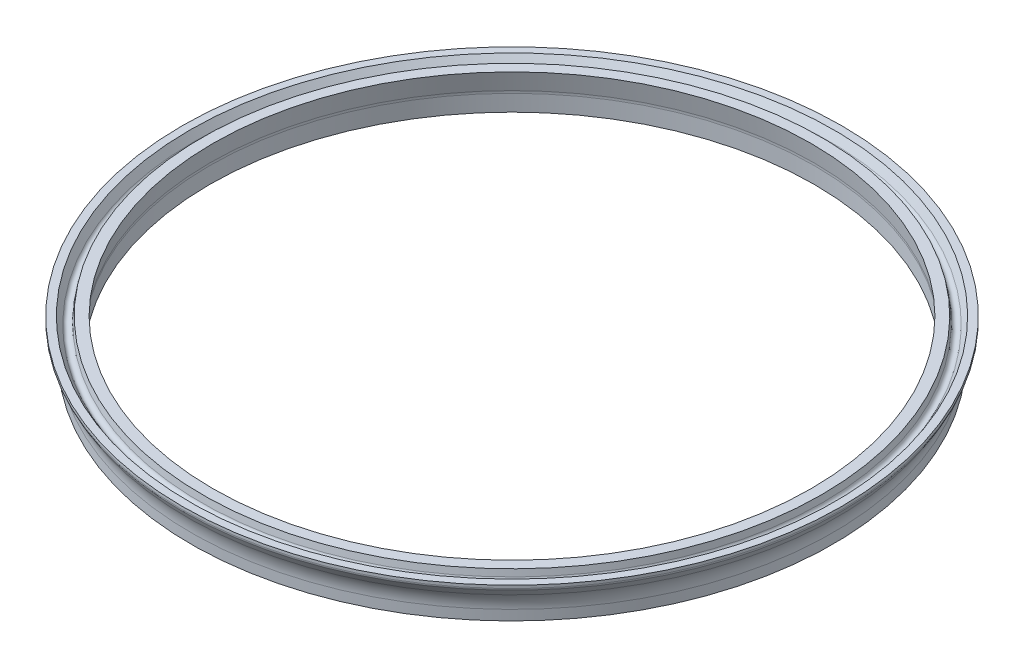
from build123d import *


with BuildPart() as part:
    # Esquisse1 → R_volution1 (revolve)
    with BuildSketch(Plane.XY):
        with BuildLine():
            Line((-3.6, 78), (1.251429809, 78))
            Line((1.251429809, 78), (1.251429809, 82.256509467))
            ThreePointArc((1.251429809, 82.256509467), (1.264941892, 82.585012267), (1.305386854, 82.911295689))
            Line((1.305386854, 82.911295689), (2.1, 87.7))
            Line((2.1, 87.7), (-0.636919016, 87.7))
            Line((-0.636919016, 87.7), (-0.910920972, 86.04873818))
            ThreePointArc((-0.910920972, 86.04873818), (-1.714268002, 85.22935231), (-2.758797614, 85.704449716))
            Line((-2.758797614, 85.704449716), (-3.935660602, 87.7))
            Line((-3.935660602, 87.7), (-5.9, 87.7))
            Line((-5.9, 87.7), (-5.9, 86.972909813))
            ThreePointArc((-5.9, 86.972909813), (-5.864719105, 86.709628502), (-5.761365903, 86.464924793))
            Line((-5.761365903, 86.464924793), (-4.709072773, 84.680601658))
            ThreePointArc((-4.709072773, 84.680601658), (-3.882247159, 82.722971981), (-3.6, 80.616721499))
            Line((-3.6, 80.616721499), (-3.6, 78))
        make_face()
    revolve(axis=Axis((80.1, 96.925, 0), (0, -1, 0)))


solid = part.part
